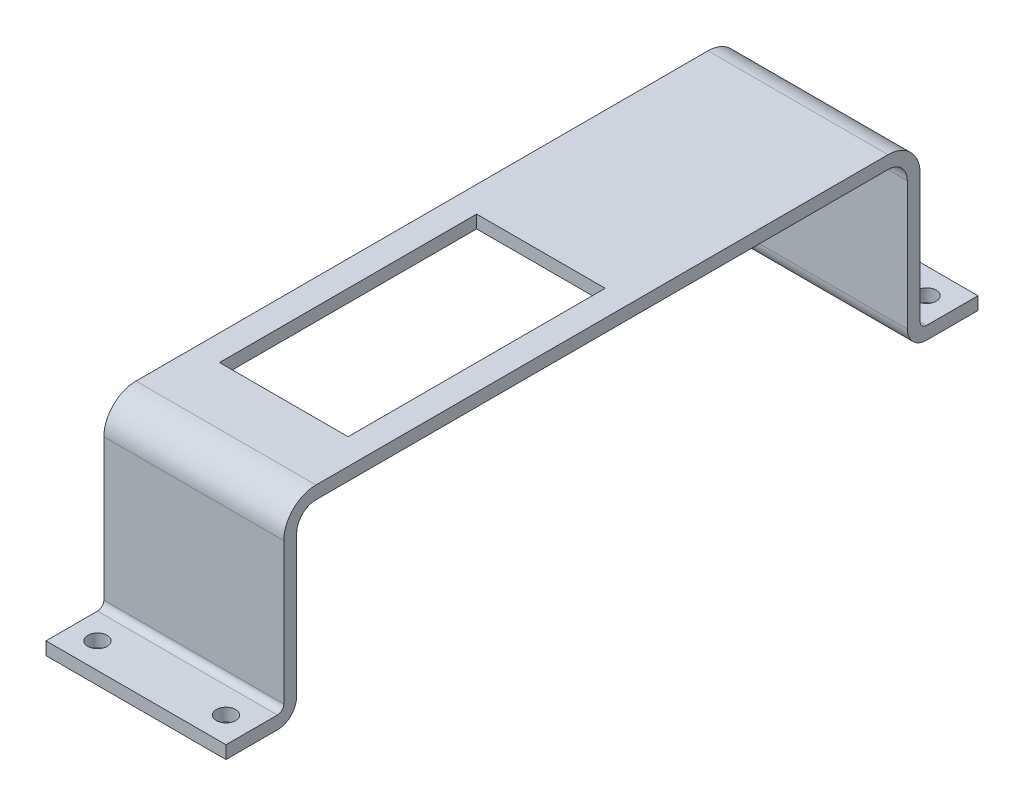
ISO-10303-21;
HEADER;
FILE_DESCRIPTION(('STEP AP214'),'2;1');
FILE_NAME('part.step','',(''),(''),'','','');
FILE_SCHEMA(('AUTOMOTIVE_DESIGN { 1 0 10303 214 1 1 1 1 }'));
ENDSEC;
DATA;
#1=APPLICATION_CONTEXT('core data for automotive mechanical design processes');
#2=APPLICATION_PROTOCOL_DEFINITION('international standard','automotive_design',2000,#1);
#3=PRODUCT_CONTEXT('',#1,'mechanical');
#4=PRODUCT('Part','Part','',(#3));
#5=PRODUCT_RELATED_PRODUCT_CATEGORY('part','',(#4));
#6=PRODUCT_DEFINITION_FORMATION('','',#4);
#7=PRODUCT_DEFINITION_CONTEXT('part definition',#1,'design');
#8=PRODUCT_DEFINITION('design','',#6,#7);
#9=PRODUCT_DEFINITION_SHAPE('','',#8);
#10=(LENGTH_UNIT() NAMED_UNIT(*) SI_UNIT(.MILLI.,.METRE.));
#11=(NAMED_UNIT(*) PLANE_ANGLE_UNIT() SI_UNIT($,.RADIAN.));
#12=(NAMED_UNIT(*) SI_UNIT($,.STERADIAN.) SOLID_ANGLE_UNIT());
#13=UNCERTAINTY_MEASURE_WITH_UNIT(LENGTH_MEASURE(1.E-05),#10,'distance_accuracy_value','');
#14=(GEOMETRIC_REPRESENTATION_CONTEXT(3) GLOBAL_UNCERTAINTY_ASSIGNED_CONTEXT((#13)) GLOBAL_UNIT_ASSIGNED_CONTEXT((#10,
#11,#12)) REPRESENTATION_CONTEXT('',''));
#15=CARTESIAN_POINT('',(0.,0.,0.));
#16=DIRECTION('',(0.,0.,1.));
#17=DIRECTION('',(1.,0.,0.));
#18=AXIS2_PLACEMENT_3D('',#15,#16,#17);
#19=CARTESIAN_POINT('',(14.,2.,-11.));
#20=DIRECTION('',(0.,0.,1.));
#21=DIRECTION('',(1.,0.,0.));
#22=AXIS2_PLACEMENT_3D('',#19,#20,#21);
#23=PLANE('',#22);
#24=DIRECTION('',(0.,1.,0.));
#25=VECTOR('',#24,1.);
#26=CARTESIAN_POINT('',(-14.,2.,-11.));
#27=LINE('',#26,#25);
#28=CARTESIAN_POINT('',(-14.,0.,-11.));
#29=VERTEX_POINT('',#28);
#30=CARTESIAN_POINT('',(-14.,2.,-11.));
#31=VERTEX_POINT('',#30);
#32=EDGE_CURVE('E221',#29,#31,#27,.T.);
#33=ORIENTED_EDGE('',*,*,#32,.T.);
#34=DIRECTION('',(-1.,0.,0.));
#35=VECTOR('',#34,1.);
#36=CARTESIAN_POINT('',(14.,2.,-11.));
#37=LINE('',#36,#35);
#38=CARTESIAN_POINT('',(14.,2.,-11.));
#39=VERTEX_POINT('',#38);
#40=EDGE_CURVE('E362',#39,#31,#37,.T.);
#41=ORIENTED_EDGE('',*,*,#40,.F.);
#42=DIRECTION('',(0.,1.,0.));
#43=VECTOR('',#42,1.);
#44=CARTESIAN_POINT('',(14.,2.,-11.));
#45=LINE('',#44,#43);
#46=CARTESIAN_POINT('',(14.,0.,-11.));
#47=VERTEX_POINT('',#46);
#48=EDGE_CURVE('E224',#47,#39,#45,.T.);
#49=ORIENTED_EDGE('',*,*,#48,.F.);
#50=DIRECTION('',(-1.,0.,0.));
#51=VECTOR('',#50,1.);
#52=CARTESIAN_POINT('',(14.,0.,-11.));
#53=LINE('',#52,#51);
#54=EDGE_CURVE('E266',#47,#29,#53,.T.);
#55=ORIENTED_EDGE('',*,*,#54,.T.);
#56=EDGE_LOOP('',(#33,#41,#49,#55));
#57=FACE_BOUND('',#56,.T.);
#58=ADVANCED_FACE('F33',(#57),#23,.F.);
#59=CARTESIAN_POINT('',(14.,2.,-3.));
#60=DIRECTION('',(0.,-1.,0.));
#61=DIRECTION('',(0.,0.,-1.));
#62=AXIS2_PLACEMENT_3D('',#59,#60,#61);
#63=PLANE('',#62);
#64=CARTESIAN_POINT('',(-10.,2.,-7.));
#65=DIRECTION('',(0.,1.,0.));
#66=DIRECTION('',(0.,0.,1.));
#67=AXIS2_PLACEMENT_3D('',#64,#65,#66);
#68=CIRCLE('',#67,1.5);
#69=CARTESIAN_POINT('',(-10.,2.,-5.5));
#70=VERTEX_POINT('',#69);
#71=EDGE_CURVE('E383',#70,#70,#68,.T.);
#72=ORIENTED_EDGE('',*,*,#71,.F.);
#73=EDGE_LOOP('',(#72));
#74=FACE_BOUND('',#73,.T.);
#75=CARTESIAN_POINT('',(10.,2.,-7.));
#76=DIRECTION('',(0.,1.,0.));
#77=DIRECTION('',(0.,0.,1.));
#78=AXIS2_PLACEMENT_3D('',#75,#76,#77);
#79=CIRCLE('',#78,1.5);
#80=CARTESIAN_POINT('',(10.,2.,-5.5));
#81=VERTEX_POINT('',#80);
#82=EDGE_CURVE('E372',#81,#81,#79,.T.);
#83=ORIENTED_EDGE('',*,*,#82,.F.);
#84=EDGE_LOOP('',(#83));
#85=FACE_BOUND('',#84,.T.);
#86=DIRECTION('',(0.,0.,1.));
#87=VECTOR('',#86,1.);
#88=CARTESIAN_POINT('',(-14.,2.,-3.));
#89=LINE('',#88,#87);
#90=CARTESIAN_POINT('',(-14.,2.,-3.));
#91=VERTEX_POINT('',#90);
#92=EDGE_CURVE('E269',#31,#91,#89,.T.);
#93=ORIENTED_EDGE('',*,*,#92,.T.);
#94=DIRECTION('',(-1.,0.,0.));
#95=VECTOR('',#94,1.);
#96=CARTESIAN_POINT('',(14.,2.,-3.));
#97=LINE('',#96,#95);
#98=CARTESIAN_POINT('',(14.,2.,-3.));
#99=VERTEX_POINT('',#98);
#100=EDGE_CURVE('E359',#99,#91,#97,.T.);
#101=ORIENTED_EDGE('',*,*,#100,.F.);
#102=DIRECTION('',(0.,0.,1.));
#103=VECTOR('',#102,1.);
#104=CARTESIAN_POINT('',(14.,2.,-3.));
#105=LINE('',#104,#103);
#106=EDGE_CURVE('E227',#39,#99,#105,.T.);
#107=ORIENTED_EDGE('',*,*,#106,.F.);
#108=ORIENTED_EDGE('',*,*,#40,.T.);
#109=EDGE_LOOP('',(#93,#101,#107,#108));
#110=FACE_BOUND('',#109,.T.);
#111=ADVANCED_FACE('F465',(#74,#85,#110),#63,.F.);
#112=CARTESIAN_POINT('',(14.,3.,-3.));
#113=DIRECTION('',(-1.,0.,0.));
#114=DIRECTION('',(0.,0.,1.));
#115=AXIS2_PLACEMENT_3D('',#112,#113,#114);
#116=CYLINDRICAL_SURFACE('',#115,1.);
#117=CARTESIAN_POINT('',(-14.,3.,-3.));
#118=DIRECTION('',(-1.,0.,0.));
#119=DIRECTION('',(0.,0.,-1.));
#120=AXIS2_PLACEMENT_3D('',#117,#118,#119);
#121=CIRCLE('',#120,1.);
#122=CARTESIAN_POINT('',(-14.,3.,-2.));
#123=VERTEX_POINT('',#122);
#124=EDGE_CURVE('E271',#91,#123,#121,.T.);
#125=ORIENTED_EDGE('',*,*,#124,.T.);
#126=DIRECTION('',(-1.,0.,0.));
#127=VECTOR('',#126,1.);
#128=CARTESIAN_POINT('',(14.,3.,-2.));
#129=LINE('',#128,#127);
#130=CARTESIAN_POINT('',(14.,3.,-2.));
#131=VERTEX_POINT('',#130);
#132=EDGE_CURVE('E356',#131,#123,#129,.T.);
#133=ORIENTED_EDGE('',*,*,#132,.F.);
#134=CARTESIAN_POINT('',(14.,3.,-3.));
#135=DIRECTION('',(-1.,0.,0.));
#136=DIRECTION('',(0.,0.,-1.));
#137=AXIS2_PLACEMENT_3D('',#134,#135,#136);
#138=CIRCLE('',#137,1.);
#139=EDGE_CURVE('E230',#99,#131,#138,.T.);
#140=ORIENTED_EDGE('',*,*,#139,.F.);
#141=ORIENTED_EDGE('',*,*,#100,.T.);
#142=EDGE_LOOP('',(#125,#133,#140,#141));
#143=FACE_BOUND('',#142,.T.);
#144=ADVANCED_FACE('F460',(#143),#116,.F.);
#145=CARTESIAN_POINT('',(14.,23.,-2.));
#146=DIRECTION('',(0.,0.,1.));
#147=DIRECTION('',(0.,-1.,0.));
#148=AXIS2_PLACEMENT_3D('',#145,#146,#147);
#149=PLANE('',#148);
#150=DIRECTION('',(0.,1.,0.));
#151=VECTOR('',#150,1.);
#152=CARTESIAN_POINT('',(-14.,23.,-2.));
#153=LINE('',#152,#151);
#154=CARTESIAN_POINT('',(-14.,23.,-2.));
#155=VERTEX_POINT('',#154);
#156=EDGE_CURVE('E273',#123,#155,#153,.T.);
#157=ORIENTED_EDGE('',*,*,#156,.T.);
#158=DIRECTION('',(-1.,0.,0.));
#159=VECTOR('',#158,1.);
#160=CARTESIAN_POINT('',(14.,23.,-2.));
#161=LINE('',#160,#159);
#162=CARTESIAN_POINT('',(14.,23.,-2.));
#163=VERTEX_POINT('',#162);
#164=EDGE_CURVE('E353',#163,#155,#161,.T.);
#165=ORIENTED_EDGE('',*,*,#164,.F.);
#166=DIRECTION('',(0.,1.,0.));
#167=VECTOR('',#166,1.);
#168=CARTESIAN_POINT('',(14.,23.,-2.));
#169=LINE('',#168,#167);
#170=EDGE_CURVE('E232',#131,#163,#169,.T.);
#171=ORIENTED_EDGE('',*,*,#170,.F.);
#172=ORIENTED_EDGE('',*,*,#132,.T.);
#173=EDGE_LOOP('',(#157,#165,#171,#172));
#174=FACE_BOUND('',#173,.T.);
#175=ADVANCED_FACE('F456',(#174),#149,.F.);
#176=CARTESIAN_POINT('',(14.,23.,3.));
#177=DIRECTION('',(-1.,0.,0.));
#178=DIRECTION('',(0.,0.,1.));
#179=AXIS2_PLACEMENT_3D('',#176,#177,#178);
#180=CYLINDRICAL_SURFACE('',#179,5.);
#181=CARTESIAN_POINT('',(-14.,23.,3.));
#182=DIRECTION('',(1.,0.,0.));
#183=DIRECTION('',(0.,0.,1.));
#184=AXIS2_PLACEMENT_3D('',#181,#182,#183);
#185=CIRCLE('',#184,5.);
#186=CARTESIAN_POINT('',(-14.,28.,3.));
#187=VERTEX_POINT('',#186);
#188=EDGE_CURVE('E275',#155,#187,#185,.T.);
#189=ORIENTED_EDGE('',*,*,#188,.T.);
#190=DIRECTION('',(-1.,0.,0.));
#191=VECTOR('',#190,1.);
#192=CARTESIAN_POINT('',(14.,28.,3.));
#193=LINE('',#192,#191);
#194=CARTESIAN_POINT('',(14.,28.,3.));
#195=VERTEX_POINT('',#194);
#196=EDGE_CURVE('E350',#195,#187,#193,.T.);
#197=ORIENTED_EDGE('',*,*,#196,.F.);
#198=CARTESIAN_POINT('',(14.,23.,3.));
#199=DIRECTION('',(1.,0.,0.));
#200=DIRECTION('',(0.,0.,1.));
#201=AXIS2_PLACEMENT_3D('',#198,#199,#200);
#202=CIRCLE('',#201,5.);
#203=EDGE_CURVE('E234',#163,#195,#202,.T.);
#204=ORIENTED_EDGE('',*,*,#203,.F.);
#205=ORIENTED_EDGE('',*,*,#164,.T.);
#206=EDGE_LOOP('',(#189,#197,#204,#205));
#207=FACE_BOUND('',#206,.T.);
#208=ADVANCED_FACE('F451',(#207),#180,.T.);
#209=CARTESIAN_POINT('',(14.,28.,3.));
#210=DIRECTION('',(0.,-1.,0.));
#211=DIRECTION('',(0.,0.,-1.));
#212=AXIS2_PLACEMENT_3D('',#209,#210,#211);
#213=PLANE('',#212);
#214=DIRECTION('',(1.,0.,0.));
#215=VECTOR('',#214,1.);
#216=CARTESIAN_POINT('',(-9.99999999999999,28.,83.));
#217=LINE('',#216,#215);
#218=CARTESIAN_POINT('',(-9.99999999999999,28.,83.));
#219=VERTEX_POINT('',#218);
#220=CARTESIAN_POINT('',(10.,28.,83.));
#221=VERTEX_POINT('',#220);
#222=EDGE_CURVE('E207',#219,#221,#217,.T.);
#223=ORIENTED_EDGE('',*,*,#222,.F.);
#224=DIRECTION('',(0.,0.,1.));
#225=VECTOR('',#224,1.);
#226=CARTESIAN_POINT('',(-9.99999999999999,28.,43.));
#227=LINE('',#226,#225);
#228=CARTESIAN_POINT('',(-9.99999999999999,28.,43.));
#229=VERTEX_POINT('',#228);
#230=EDGE_CURVE('E49',#229,#219,#227,.T.);
#231=ORIENTED_EDGE('',*,*,#230,.F.);
#232=DIRECTION('',(-1.,0.,0.));
#233=VECTOR('',#232,1.);
#234=CARTESIAN_POINT('',(-9.99999999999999,28.,43.));
#235=LINE('',#234,#233);
#236=CARTESIAN_POINT('',(10.,28.,43.));
#237=VERTEX_POINT('',#236);
#238=EDGE_CURVE('E214',#237,#229,#235,.T.);
#239=ORIENTED_EDGE('',*,*,#238,.F.);
#240=DIRECTION('',(0.,0.,-1.));
#241=VECTOR('',#240,1.);
#242=CARTESIAN_POINT('',(10.,28.,43.));
#243=LINE('',#242,#241);
#244=EDGE_CURVE('E198',#221,#237,#243,.T.);
#245=ORIENTED_EDGE('',*,*,#244,.F.);
#246=EDGE_LOOP('',(#223,#231,#239,#245));
#247=FACE_BOUND('',#246,.T.);
#248=DIRECTION('',(0.,0.,1.));
#249=VECTOR('',#248,1.);
#250=CARTESIAN_POINT('',(-14.,28.,3.));
#251=LINE('',#250,#249);
#252=CARTESIAN_POINT('',(-14.,28.,92.));
#253=VERTEX_POINT('',#252);
#254=EDGE_CURVE('E277',#187,#253,#251,.T.);
#255=ORIENTED_EDGE('',*,*,#254,.T.);
#256=DIRECTION('',(-1.,0.,0.));
#257=VECTOR('',#256,1.);
#258=CARTESIAN_POINT('',(14.,28.,92.));
#259=LINE('',#258,#257);
#260=CARTESIAN_POINT('',(14.,28.,92.));
#261=VERTEX_POINT('',#260);
#262=EDGE_CURVE('E347',#261,#253,#259,.T.);
#263=ORIENTED_EDGE('',*,*,#262,.F.);
#264=DIRECTION('',(0.,0.,1.));
#265=VECTOR('',#264,1.);
#266=CARTESIAN_POINT('',(14.,28.,3.));
#267=LINE('',#266,#265);
#268=EDGE_CURVE('E236',#195,#261,#267,.T.);
#269=ORIENTED_EDGE('',*,*,#268,.F.);
#270=ORIENTED_EDGE('',*,*,#196,.T.);
#271=EDGE_LOOP('',(#255,#263,#269,#270));
#272=FACE_BOUND('',#271,.T.);
#273=ADVANCED_FACE('F211',(#247,#272),#213,.F.);
#274=CARTESIAN_POINT('',(14.,23.,92.));
#275=DIRECTION('',(-1.,0.,0.));
#276=DIRECTION('',(0.,0.,1.));
#277=AXIS2_PLACEMENT_3D('',#274,#275,#276);
#278=CYLINDRICAL_SURFACE('',#277,5.);
#279=CARTESIAN_POINT('',(-14.,23.,92.));
#280=DIRECTION('',(1.,0.,0.));
#281=DIRECTION('',(0.,0.,-1.));
#282=AXIS2_PLACEMENT_3D('',#279,#280,#281);
#283=CIRCLE('',#282,5.);
#284=CARTESIAN_POINT('',(-14.,23.,97.));
#285=VERTEX_POINT('',#284);
#286=EDGE_CURVE('E279',#253,#285,#283,.T.);
#287=ORIENTED_EDGE('',*,*,#286,.T.);
#288=DIRECTION('',(-1.,0.,0.));
#289=VECTOR('',#288,1.);
#290=CARTESIAN_POINT('',(14.,23.,97.));
#291=LINE('',#290,#289);
#292=CARTESIAN_POINT('',(14.,23.,97.));
#293=VERTEX_POINT('',#292);
#294=EDGE_CURVE('E344',#293,#285,#291,.T.);
#295=ORIENTED_EDGE('',*,*,#294,.F.);
#296=CARTESIAN_POINT('',(14.,23.,92.));
#297=DIRECTION('',(1.,0.,0.));
#298=DIRECTION('',(0.,0.,-1.));
#299=AXIS2_PLACEMENT_3D('',#296,#297,#298);
#300=CIRCLE('',#299,5.);
#301=EDGE_CURVE('E238',#261,#293,#300,.T.);
#302=ORIENTED_EDGE('',*,*,#301,.F.);
#303=ORIENTED_EDGE('',*,*,#262,.T.);
#304=EDGE_LOOP('',(#287,#295,#302,#303));
#305=FACE_BOUND('',#304,.T.);
#306=ADVANCED_FACE('F443',(#305),#278,.T.);
#307=CARTESIAN_POINT('',(14.,23.,97.));
#308=DIRECTION('',(0.,0.,-1.));
#309=DIRECTION('',(-1.,0.,0.));
#310=AXIS2_PLACEMENT_3D('',#307,#308,#309);
#311=PLANE('',#310);
#312=DIRECTION('',(0.,-1.,0.));
#313=VECTOR('',#312,1.);
#314=CARTESIAN_POINT('',(-14.,23.,97.));
#315=LINE('',#314,#313);
#316=CARTESIAN_POINT('',(-14.,0.999999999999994,97.));
#317=VERTEX_POINT('',#316);
#318=EDGE_CURVE('E281',#285,#317,#315,.T.);
#319=ORIENTED_EDGE('',*,*,#318,.T.);
#320=DIRECTION('',(-1.,0.,0.));
#321=VECTOR('',#320,1.);
#322=CARTESIAN_POINT('',(14.,0.999999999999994,97.));
#323=LINE('',#322,#321);
#324=CARTESIAN_POINT('',(14.,0.999999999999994,97.));
#325=VERTEX_POINT('',#324);
#326=EDGE_CURVE('E341',#325,#317,#323,.T.);
#327=ORIENTED_EDGE('',*,*,#326,.F.);
#328=DIRECTION('',(0.,-1.,0.));
#329=VECTOR('',#328,1.);
#330=CARTESIAN_POINT('',(14.,23.,97.));
#331=LINE('',#330,#329);
#332=EDGE_CURVE('E240',#293,#325,#331,.T.);
#333=ORIENTED_EDGE('',*,*,#332,.F.);
#334=ORIENTED_EDGE('',*,*,#294,.T.);
#335=EDGE_LOOP('',(#319,#327,#333,#334));
#336=FACE_BOUND('',#335,.T.);
#337=ADVANCED_FACE('F439',(#336),#311,.F.);
#338=CARTESIAN_POINT('',(14.,0.999999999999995,98.));
#339=DIRECTION('',(-1.,0.,0.));
#340=DIRECTION('',(0.,0.,1.));
#341=AXIS2_PLACEMENT_3D('',#338,#339,#340);
#342=CYLINDRICAL_SURFACE('',#341,1.);
#343=CARTESIAN_POINT('',(-14.,0.999999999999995,98.));
#344=DIRECTION('',(-1.,0.,0.));
#345=DIRECTION('',(0.,0.,1.));
#346=AXIS2_PLACEMENT_3D('',#343,#344,#345);
#347=CIRCLE('',#346,1.);
#348=CARTESIAN_POINT('',(-14.,0.,98.));
#349=VERTEX_POINT('',#348);
#350=EDGE_CURVE('E283',#317,#349,#347,.T.);
#351=ORIENTED_EDGE('',*,*,#350,.T.);
#352=DIRECTION('',(-1.,0.,0.));
#353=VECTOR('',#352,1.);
#354=CARTESIAN_POINT('',(14.,0.,98.));
#355=LINE('',#354,#353);
#356=CARTESIAN_POINT('',(14.,0.,98.));
#357=VERTEX_POINT('',#356);
#358=EDGE_CURVE('E338',#357,#349,#355,.T.);
#359=ORIENTED_EDGE('',*,*,#358,.F.);
#360=CARTESIAN_POINT('',(14.,0.999999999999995,98.));
#361=DIRECTION('',(-1.,0.,0.));
#362=DIRECTION('',(0.,0.,1.));
#363=AXIS2_PLACEMENT_3D('',#360,#361,#362);
#364=CIRCLE('',#363,1.);
#365=EDGE_CURVE('E242',#325,#357,#364,.T.);
#366=ORIENTED_EDGE('',*,*,#365,.F.);
#367=ORIENTED_EDGE('',*,*,#326,.T.);
#368=EDGE_LOOP('',(#351,#359,#366,#367));
#369=FACE_BOUND('',#368,.T.);
#370=ADVANCED_FACE('F401',(#369),#342,.F.);
#371=CARTESIAN_POINT('',(14.,0.,98.));
#372=DIRECTION('',(0.,-1.,0.));
#373=DIRECTION('',(0.,0.,-1.));
#374=AXIS2_PLACEMENT_3D('',#371,#372,#373);
#375=PLANE('',#374);
#376=CARTESIAN_POINT('',(-10.,0.,102.));
#377=DIRECTION('',(0.,1.,0.));
#378=DIRECTION('',(0.,0.,1.));
#379=AXIS2_PLACEMENT_3D('',#376,#377,#378);
#380=CIRCLE('',#379,1.5);
#381=CARTESIAN_POINT('',(-10.,0.,103.5));
#382=VERTEX_POINT('',#381);
#383=EDGE_CURVE('E371',#382,#382,#380,.T.);
#384=ORIENTED_EDGE('',*,*,#383,.F.);
#385=EDGE_LOOP('',(#384));
#386=FACE_BOUND('',#385,.T.);
#387=CARTESIAN_POINT('',(10.,0.,102.));
#388=DIRECTION('',(0.,1.,0.));
#389=DIRECTION('',(0.,0.,1.));
#390=AXIS2_PLACEMENT_3D('',#387,#388,#389);
#391=CIRCLE('',#390,1.5);
#392=CARTESIAN_POINT('',(10.,0.,103.5));
#393=VERTEX_POINT('',#392);
#394=EDGE_CURVE('E387',#393,#393,#391,.T.);
#395=ORIENTED_EDGE('',*,*,#394,.F.);
#396=EDGE_LOOP('',(#395));
#397=FACE_BOUND('',#396,.T.);
#398=DIRECTION('',(0.,0.,1.));
#399=VECTOR('',#398,1.);
#400=CARTESIAN_POINT('',(-14.,0.,98.));
#401=LINE('',#400,#399);
#402=CARTESIAN_POINT('',(-14.,0.,106.));
#403=VERTEX_POINT('',#402);
#404=EDGE_CURVE('E285',#349,#403,#401,.T.);
#405=ORIENTED_EDGE('',*,*,#404,.T.);
#406=DIRECTION('',(-1.,0.,0.));
#407=VECTOR('',#406,1.);
#408=CARTESIAN_POINT('',(14.,0.,106.));
#409=LINE('',#408,#407);
#410=CARTESIAN_POINT('',(14.,0.,106.));
#411=VERTEX_POINT('',#410);
#412=EDGE_CURVE('E335',#411,#403,#409,.T.);
#413=ORIENTED_EDGE('',*,*,#412,.F.);
#414=DIRECTION('',(0.,0.,1.));
#415=VECTOR('',#414,1.);
#416=CARTESIAN_POINT('',(14.,0.,98.));
#417=LINE('',#416,#415);
#418=EDGE_CURVE('E244',#357,#411,#417,.T.);
#419=ORIENTED_EDGE('',*,*,#418,.F.);
#420=ORIENTED_EDGE('',*,*,#358,.T.);
#421=EDGE_LOOP('',(#405,#413,#419,#420));
#422=FACE_BOUND('',#421,.T.);
#423=ADVANCED_FACE('F397',(#386,#397,#422),#375,.F.);
#424=CARTESIAN_POINT('',(14.,0.,106.));
#425=DIRECTION('',(0.,0.,-1.));
#426=DIRECTION('',(-1.,0.,0.));
#427=AXIS2_PLACEMENT_3D('',#424,#425,#426);
#428=PLANE('',#427);
#429=DIRECTION('',(0.,-1.,0.));
#430=VECTOR('',#429,1.);
#431=CARTESIAN_POINT('',(-14.,0.,106.));
#432=LINE('',#431,#430);
#433=CARTESIAN_POINT('',(-14.,-2.00000000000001,106.));
#434=VERTEX_POINT('',#433);
#435=EDGE_CURVE('E287',#403,#434,#432,.T.);
#436=ORIENTED_EDGE('',*,*,#435,.T.);
#437=DIRECTION('',(-1.,0.,0.));
#438=VECTOR('',#437,1.);
#439=CARTESIAN_POINT('',(14.,-2.00000000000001,106.));
#440=LINE('',#439,#438);
#441=CARTESIAN_POINT('',(14.,-2.00000000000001,106.));
#442=VERTEX_POINT('',#441);
#443=EDGE_CURVE('E332',#442,#434,#440,.T.);
#444=ORIENTED_EDGE('',*,*,#443,.F.);
#445=DIRECTION('',(0.,-1.,0.));
#446=VECTOR('',#445,1.);
#447=CARTESIAN_POINT('',(14.,0.,106.));
#448=LINE('',#447,#446);
#449=EDGE_CURVE('E246',#411,#442,#448,.T.);
#450=ORIENTED_EDGE('',*,*,#449,.F.);
#451=ORIENTED_EDGE('',*,*,#412,.T.);
#452=EDGE_LOOP('',(#436,#444,#450,#451));
#453=FACE_BOUND('',#452,.T.);
#454=ADVANCED_FACE('F400',(#453),#428,.F.);
#455=CARTESIAN_POINT('',(14.,-2.00000000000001,98.));
#456=DIRECTION('',(0.,1.,0.));
#457=DIRECTION('',(0.,0.,1.));
#458=AXIS2_PLACEMENT_3D('',#455,#456,#457);
#459=PLANE('',#458);
#460=CARTESIAN_POINT('',(-10.,-2.00000000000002,102.));
#461=DIRECTION('',(0.,1.,0.));
#462=DIRECTION('',(0.,0.,1.));
#463=AXIS2_PLACEMENT_3D('',#460,#461,#462);
#464=CIRCLE('',#463,1.5);
#465=CARTESIAN_POINT('',(-10.,-2.00000000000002,103.5));
#466=VERTEX_POINT('',#465);
#467=EDGE_CURVE('E376',#466,#466,#464,.T.);
#468=ORIENTED_EDGE('',*,*,#467,.T.);
#469=EDGE_LOOP('',(#468));
#470=FACE_BOUND('',#469,.T.);
#471=CARTESIAN_POINT('',(10.,-2.00000000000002,102.));
#472=DIRECTION('',(0.,1.,0.));
#473=DIRECTION('',(0.,0.,1.));
#474=AXIS2_PLACEMENT_3D('',#471,#472,#473);
#475=CIRCLE('',#474,1.5);
#476=CARTESIAN_POINT('',(10.,-2.00000000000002,103.5));
#477=VERTEX_POINT('',#476);
#478=EDGE_CURVE('E389',#477,#477,#475,.T.);
#479=ORIENTED_EDGE('',*,*,#478,.T.);
#480=EDGE_LOOP('',(#479));
#481=FACE_BOUND('',#480,.T.);
#482=DIRECTION('',(0.,0.,-1.));
#483=VECTOR('',#482,1.);
#484=CARTESIAN_POINT('',(-14.,-2.00000000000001,98.));
#485=LINE('',#484,#483);
#486=CARTESIAN_POINT('',(-14.,-2.00000000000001,98.));
#487=VERTEX_POINT('',#486);
#488=EDGE_CURVE('E289',#434,#487,#485,.T.);
#489=ORIENTED_EDGE('',*,*,#488,.T.);
#490=DIRECTION('',(-1.,0.,0.));
#491=VECTOR('',#490,1.);
#492=CARTESIAN_POINT('',(14.,-2.00000000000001,98.));
#493=LINE('',#492,#491);
#494=CARTESIAN_POINT('',(14.,-2.00000000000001,98.));
#495=VERTEX_POINT('',#494);
#496=EDGE_CURVE('E329',#495,#487,#493,.T.);
#497=ORIENTED_EDGE('',*,*,#496,.F.);
#498=DIRECTION('',(0.,0.,-1.));
#499=VECTOR('',#498,1.);
#500=CARTESIAN_POINT('',(14.,-2.00000000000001,98.));
#501=LINE('',#500,#499);
#502=EDGE_CURVE('E248',#442,#495,#501,.T.);
#503=ORIENTED_EDGE('',*,*,#502,.F.);
#504=ORIENTED_EDGE('',*,*,#443,.T.);
#505=EDGE_LOOP('',(#489,#497,#503,#504));
#506=FACE_BOUND('',#505,.T.);
#507=ADVANCED_FACE('F421',(#470,#481,#506),#459,.F.);
#508=CARTESIAN_POINT('',(14.,0.999999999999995,98.));
#509=DIRECTION('',(-1.,0.,0.));
#510=DIRECTION('',(0.,0.,1.));
#511=AXIS2_PLACEMENT_3D('',#508,#509,#510);
#512=CYLINDRICAL_SURFACE('',#511,3.);
#513=CARTESIAN_POINT('',(-14.,0.999999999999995,98.));
#514=DIRECTION('',(1.,0.,0.));
#515=DIRECTION('',(0.,0.,1.));
#516=AXIS2_PLACEMENT_3D('',#513,#514,#515);
#517=CIRCLE('',#516,3.);
#518=CARTESIAN_POINT('',(-14.,0.999999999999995,95.));
#519=VERTEX_POINT('',#518);
#520=EDGE_CURVE('E291',#487,#519,#517,.T.);
#521=ORIENTED_EDGE('',*,*,#520,.T.);
#522=DIRECTION('',(-1.,0.,0.));
#523=VECTOR('',#522,1.);
#524=CARTESIAN_POINT('',(14.,0.999999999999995,95.));
#525=LINE('',#524,#523);
#526=CARTESIAN_POINT('',(14.,0.999999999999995,95.));
#527=VERTEX_POINT('',#526);
#528=EDGE_CURVE('E326',#527,#519,#525,.T.);
#529=ORIENTED_EDGE('',*,*,#528,.F.);
#530=CARTESIAN_POINT('',(14.,0.999999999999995,98.));
#531=DIRECTION('',(1.,0.,0.));
#532=DIRECTION('',(0.,0.,1.));
#533=AXIS2_PLACEMENT_3D('',#530,#531,#532);
#534=CIRCLE('',#533,3.);
#535=EDGE_CURVE('E250',#495,#527,#534,.T.);
#536=ORIENTED_EDGE('',*,*,#535,.F.);
#537=ORIENTED_EDGE('',*,*,#496,.T.);
#538=EDGE_LOOP('',(#521,#529,#536,#537));
#539=FACE_BOUND('',#538,.T.);
#540=ADVANCED_FACE('F425',(#539),#512,.T.);
#541=CARTESIAN_POINT('',(14.,23.,95.));
#542=DIRECTION('',(0.,0.,1.));
#543=DIRECTION('',(1.,0.,0.));
#544=AXIS2_PLACEMENT_3D('',#541,#542,#543);
#545=PLANE('',#544);
#546=DIRECTION('',(0.,1.,0.));
#547=VECTOR('',#546,1.);
#548=CARTESIAN_POINT('',(-14.,23.,95.));
#549=LINE('',#548,#547);
#550=CARTESIAN_POINT('',(-14.,23.,95.));
#551=VERTEX_POINT('',#550);
#552=EDGE_CURVE('E293',#519,#551,#549,.T.);
#553=ORIENTED_EDGE('',*,*,#552,.T.);
#554=DIRECTION('',(-1.,0.,0.));
#555=VECTOR('',#554,1.);
#556=CARTESIAN_POINT('',(14.,23.,95.));
#557=LINE('',#556,#555);
#558=CARTESIAN_POINT('',(14.,23.,95.));
#559=VERTEX_POINT('',#558);
#560=EDGE_CURVE('E323',#559,#551,#557,.T.);
#561=ORIENTED_EDGE('',*,*,#560,.F.);
#562=DIRECTION('',(0.,1.,0.));
#563=VECTOR('',#562,1.);
#564=CARTESIAN_POINT('',(14.,23.,95.));
#565=LINE('',#564,#563);
#566=EDGE_CURVE('E252',#527,#559,#565,.T.);
#567=ORIENTED_EDGE('',*,*,#566,.F.);
#568=ORIENTED_EDGE('',*,*,#528,.T.);
#569=EDGE_LOOP('',(#553,#561,#567,#568));
#570=FACE_BOUND('',#569,.T.);
#571=ADVANCED_FACE('F498',(#570),#545,.F.);
#572=CARTESIAN_POINT('',(14.,23.,92.));
#573=DIRECTION('',(-1.,0.,0.));
#574=DIRECTION('',(0.,0.,1.));
#575=AXIS2_PLACEMENT_3D('',#572,#573,#574);
#576=CYLINDRICAL_SURFACE('',#575,3.);
#577=CARTESIAN_POINT('',(-14.,23.,92.));
#578=DIRECTION('',(-1.,0.,0.));
#579=DIRECTION('',(0.,0.,-1.));
#580=AXIS2_PLACEMENT_3D('',#577,#578,#579);
#581=CIRCLE('',#580,3.);
#582=CARTESIAN_POINT('',(-14.,26.,92.));
#583=VERTEX_POINT('',#582);
#584=EDGE_CURVE('E295',#551,#583,#581,.T.);
#585=ORIENTED_EDGE('',*,*,#584,.T.);
#586=DIRECTION('',(-1.,0.,0.));
#587=VECTOR('',#586,1.);
#588=CARTESIAN_POINT('',(14.,26.,92.));
#589=LINE('',#588,#587);
#590=CARTESIAN_POINT('',(14.,26.,92.));
#591=VERTEX_POINT('',#590);
#592=EDGE_CURVE('E320',#591,#583,#589,.T.);
#593=ORIENTED_EDGE('',*,*,#592,.F.);
#594=CARTESIAN_POINT('',(14.,23.,92.));
#595=DIRECTION('',(-1.,0.,0.));
#596=DIRECTION('',(0.,0.,-1.));
#597=AXIS2_PLACEMENT_3D('',#594,#595,#596);
#598=CIRCLE('',#597,3.);
#599=EDGE_CURVE('E254',#559,#591,#598,.T.);
#600=ORIENTED_EDGE('',*,*,#599,.F.);
#601=ORIENTED_EDGE('',*,*,#560,.T.);
#602=EDGE_LOOP('',(#585,#593,#600,#601));
#603=FACE_BOUND('',#602,.T.);
#604=ADVANCED_FACE('F496',(#603),#576,.F.);
#605=CARTESIAN_POINT('',(14.,26.,3.));
#606=DIRECTION('',(0.,1.,0.));
#607=DIRECTION('',(0.,0.,1.));
#608=AXIS2_PLACEMENT_3D('',#605,#606,#607);
#609=PLANE('',#608);
#610=DIRECTION('',(-1.,0.,0.));
#611=VECTOR('',#610,1.);
#612=CARTESIAN_POINT('',(14.,26.,43.));
#613=LINE('',#612,#611);
#614=CARTESIAN_POINT('',(10.,26.,43.));
#615=VERTEX_POINT('',#614);
#616=CARTESIAN_POINT('',(-9.99999999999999,26.,43.));
#617=VERTEX_POINT('',#616);
#618=EDGE_CURVE('E41',#615,#617,#613,.T.);
#619=ORIENTED_EDGE('',*,*,#618,.T.);
#620=DIRECTION('',(0.,0.,1.));
#621=VECTOR('',#620,1.);
#622=CARTESIAN_POINT('',(-10.,26.,3.));
#623=LINE('',#622,#621);
#624=CARTESIAN_POINT('',(-9.99999999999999,26.,83.));
#625=VERTEX_POINT('',#624);
#626=EDGE_CURVE('E11',#617,#625,#623,.T.);
#627=ORIENTED_EDGE('',*,*,#626,.T.);
#628=DIRECTION('',(1.,0.,0.));
#629=VECTOR('',#628,1.);
#630=CARTESIAN_POINT('',(14.,26.,83.));
#631=LINE('',#630,#629);
#632=CARTESIAN_POINT('',(10.,26.,83.));
#633=VERTEX_POINT('',#632);
#634=EDGE_CURVE('E365',#625,#633,#631,.T.);
#635=ORIENTED_EDGE('',*,*,#634,.T.);
#636=DIRECTION('',(0.,0.,-1.));
#637=VECTOR('',#636,1.);
#638=CARTESIAN_POINT('',(10.,26.,3.));
#639=LINE('',#638,#637);
#640=EDGE_CURVE('E201',#633,#615,#639,.T.);
#641=ORIENTED_EDGE('',*,*,#640,.T.);
#642=EDGE_LOOP('',(#619,#627,#635,#641));
#643=FACE_BOUND('',#642,.T.);
#644=DIRECTION('',(0.,0.,-1.));
#645=VECTOR('',#644,1.);
#646=CARTESIAN_POINT('',(-14.,26.,3.));
#647=LINE('',#646,#645);
#648=CARTESIAN_POINT('',(-14.,26.,3.));
#649=VERTEX_POINT('',#648);
#650=EDGE_CURVE('E297',#583,#649,#647,.T.);
#651=ORIENTED_EDGE('',*,*,#650,.T.);
#652=DIRECTION('',(-1.,0.,0.));
#653=VECTOR('',#652,1.);
#654=CARTESIAN_POINT('',(14.,26.,3.));
#655=LINE('',#654,#653);
#656=CARTESIAN_POINT('',(14.,26.,3.));
#657=VERTEX_POINT('',#656);
#658=EDGE_CURVE('E317',#657,#649,#655,.T.);
#659=ORIENTED_EDGE('',*,*,#658,.F.);
#660=DIRECTION('',(0.,0.,-1.));
#661=VECTOR('',#660,1.);
#662=CARTESIAN_POINT('',(14.,26.,3.));
#663=LINE('',#662,#661);
#664=EDGE_CURVE('E256',#591,#657,#663,.T.);
#665=ORIENTED_EDGE('',*,*,#664,.F.);
#666=ORIENTED_EDGE('',*,*,#592,.T.);
#667=EDGE_LOOP('',(#651,#659,#665,#666));
#668=FACE_BOUND('',#667,.T.);
#669=ADVANCED_FACE('F491',(#643,#668),#609,.F.);
#670=CARTESIAN_POINT('',(14.,23.,3.));
#671=DIRECTION('',(-1.,0.,0.));
#672=DIRECTION('',(0.,0.,1.));
#673=AXIS2_PLACEMENT_3D('',#670,#671,#672);
#674=CYLINDRICAL_SURFACE('',#673,3.);
#675=CARTESIAN_POINT('',(-14.,23.,3.));
#676=DIRECTION('',(-1.,0.,0.));
#677=DIRECTION('',(0.,0.,1.));
#678=AXIS2_PLACEMENT_3D('',#675,#676,#677);
#679=CIRCLE('',#678,3.);
#680=CARTESIAN_POINT('',(-14.,23.,0.));
#681=VERTEX_POINT('',#680);
#682=EDGE_CURVE('E299',#649,#681,#679,.T.);
#683=ORIENTED_EDGE('',*,*,#682,.T.);
#684=DIRECTION('',(-1.,0.,0.));
#685=VECTOR('',#684,1.);
#686=CARTESIAN_POINT('',(14.,23.,0.));
#687=LINE('',#686,#685);
#688=CARTESIAN_POINT('',(14.,23.,0.));
#689=VERTEX_POINT('',#688);
#690=EDGE_CURVE('E314',#689,#681,#687,.T.);
#691=ORIENTED_EDGE('',*,*,#690,.F.);
#692=CARTESIAN_POINT('',(14.,23.,3.));
#693=DIRECTION('',(-1.,0.,0.));
#694=DIRECTION('',(0.,0.,1.));
#695=AXIS2_PLACEMENT_3D('',#692,#693,#694);
#696=CIRCLE('',#695,3.);
#697=EDGE_CURVE('E258',#657,#689,#696,.T.);
#698=ORIENTED_EDGE('',*,*,#697,.F.);
#699=ORIENTED_EDGE('',*,*,#658,.T.);
#700=EDGE_LOOP('',(#683,#691,#698,#699));
#701=FACE_BOUND('',#700,.T.);
#702=ADVANCED_FACE('F486',(#701),#674,.F.);
#703=CARTESIAN_POINT('',(14.,23.,0.));
#704=DIRECTION('',(0.,0.,-1.));
#705=DIRECTION('',(0.,1.,0.));
#706=AXIS2_PLACEMENT_3D('',#703,#704,#705);
#707=PLANE('',#706);
#708=DIRECTION('',(0.,-1.,0.));
#709=VECTOR('',#708,1.);
#710=CARTESIAN_POINT('',(-14.,23.,0.));
#711=LINE('',#710,#709);
#712=CARTESIAN_POINT('',(-14.,3.,0.));
#713=VERTEX_POINT('',#712);
#714=EDGE_CURVE('E301',#681,#713,#711,.T.);
#715=ORIENTED_EDGE('',*,*,#714,.T.);
#716=DIRECTION('',(-1.,0.,0.));
#717=VECTOR('',#716,1.);
#718=CARTESIAN_POINT('',(14.,3.,0.));
#719=LINE('',#718,#717);
#720=CARTESIAN_POINT('',(14.,3.,0.));
#721=VERTEX_POINT('',#720);
#722=EDGE_CURVE('E311',#721,#713,#719,.T.);
#723=ORIENTED_EDGE('',*,*,#722,.F.);
#724=DIRECTION('',(0.,-1.,0.));
#725=VECTOR('',#724,1.);
#726=CARTESIAN_POINT('',(14.,23.,0.));
#727=LINE('',#726,#725);
#728=EDGE_CURVE('E260',#689,#721,#727,.T.);
#729=ORIENTED_EDGE('',*,*,#728,.F.);
#730=ORIENTED_EDGE('',*,*,#690,.T.);
#731=EDGE_LOOP('',(#715,#723,#729,#730));
#732=FACE_BOUND('',#731,.T.);
#733=ADVANCED_FACE('F482',(#732),#707,.F.);
#734=CARTESIAN_POINT('',(14.,3.,-3.));
#735=DIRECTION('',(-1.,0.,0.));
#736=DIRECTION('',(0.,0.,1.));
#737=AXIS2_PLACEMENT_3D('',#734,#735,#736);
#738=CYLINDRICAL_SURFACE('',#737,3.);
#739=CARTESIAN_POINT('',(-14.,3.,-3.));
#740=DIRECTION('',(1.,0.,0.));
#741=DIRECTION('',(0.,0.,-1.));
#742=AXIS2_PLACEMENT_3D('',#739,#740,#741);
#743=CIRCLE('',#742,3.);
#744=CARTESIAN_POINT('',(-14.,0.,-3.));
#745=VERTEX_POINT('',#744);
#746=EDGE_CURVE('E303',#713,#745,#743,.T.);
#747=ORIENTED_EDGE('',*,*,#746,.T.);
#748=DIRECTION('',(-1.,0.,0.));
#749=VECTOR('',#748,1.);
#750=CARTESIAN_POINT('',(14.,0.,-3.));
#751=LINE('',#750,#749);
#752=CARTESIAN_POINT('',(14.,0.,-3.));
#753=VERTEX_POINT('',#752);
#754=EDGE_CURVE('E308',#753,#745,#751,.T.);
#755=ORIENTED_EDGE('',*,*,#754,.F.);
#756=CARTESIAN_POINT('',(14.,3.,-3.));
#757=DIRECTION('',(1.,0.,0.));
#758=DIRECTION('',(0.,0.,-1.));
#759=AXIS2_PLACEMENT_3D('',#756,#757,#758);
#760=CIRCLE('',#759,3.);
#761=EDGE_CURVE('E262',#721,#753,#760,.T.);
#762=ORIENTED_EDGE('',*,*,#761,.F.);
#763=ORIENTED_EDGE('',*,*,#722,.T.);
#764=EDGE_LOOP('',(#747,#755,#762,#763));
#765=FACE_BOUND('',#764,.T.);
#766=ADVANCED_FACE('F477',(#765),#738,.T.);
#767=CARTESIAN_POINT('',(14.,0.,-3.));
#768=DIRECTION('',(0.,1.,0.));
#769=DIRECTION('',(0.,0.,1.));
#770=AXIS2_PLACEMENT_3D('',#767,#768,#769);
#771=PLANE('',#770);
#772=CARTESIAN_POINT('',(-10.,0.,-7.));
#773=DIRECTION('',(0.,1.,0.));
#774=DIRECTION('',(0.,0.,1.));
#775=AXIS2_PLACEMENT_3D('',#772,#773,#774);
#776=CIRCLE('',#775,1.5);
#777=CARTESIAN_POINT('',(-10.,0.,-5.5));
#778=VERTEX_POINT('',#777);
#779=EDGE_CURVE('E36',#778,#778,#776,.T.);
#780=ORIENTED_EDGE('',*,*,#779,.T.);
#781=EDGE_LOOP('',(#780));
#782=FACE_BOUND('',#781,.T.);
#783=CARTESIAN_POINT('',(10.,0.,-7.));
#784=DIRECTION('',(0.,1.,0.));
#785=DIRECTION('',(0.,0.,1.));
#786=AXIS2_PLACEMENT_3D('',#783,#784,#785);
#787=CIRCLE('',#786,1.5);
#788=CARTESIAN_POINT('',(10.,0.,-5.5));
#789=VERTEX_POINT('',#788);
#790=EDGE_CURVE('E369',#789,#789,#787,.T.);
#791=ORIENTED_EDGE('',*,*,#790,.T.);
#792=EDGE_LOOP('',(#791));
#793=FACE_BOUND('',#792,.T.);
#794=DIRECTION('',(0.,0.,-1.));
#795=VECTOR('',#794,1.);
#796=CARTESIAN_POINT('',(-14.,0.,-3.));
#797=LINE('',#796,#795);
#798=EDGE_CURVE('E228',#745,#29,#797,.T.);
#799=ORIENTED_EDGE('',*,*,#798,.T.);
#800=ORIENTED_EDGE('',*,*,#54,.F.);
#801=DIRECTION('',(0.,0.,-1.));
#802=VECTOR('',#801,1.);
#803=CARTESIAN_POINT('',(14.,0.,-3.));
#804=LINE('',#803,#802);
#805=EDGE_CURVE('E264',#753,#47,#804,.T.);
#806=ORIENTED_EDGE('',*,*,#805,.F.);
#807=ORIENTED_EDGE('',*,*,#754,.T.);
#808=EDGE_LOOP('',(#799,#800,#806,#807));
#809=FACE_BOUND('',#808,.T.);
#810=ADVANCED_FACE('F471',(#782,#793,#809),#771,.F.);
#811=CARTESIAN_POINT('',(14.,3.,-3.));
#812=DIRECTION('',(1.,0.,0.));
#813=DIRECTION('',(0.,0.,-1.));
#814=AXIS2_PLACEMENT_3D('',#811,#812,#813);
#815=PLANE('',#814);
#816=ORIENTED_EDGE('',*,*,#48,.T.);
#817=ORIENTED_EDGE('',*,*,#106,.T.);
#818=ORIENTED_EDGE('',*,*,#139,.T.);
#819=ORIENTED_EDGE('',*,*,#170,.T.);
#820=ORIENTED_EDGE('',*,*,#203,.T.);
#821=ORIENTED_EDGE('',*,*,#268,.T.);
#822=ORIENTED_EDGE('',*,*,#301,.T.);
#823=ORIENTED_EDGE('',*,*,#332,.T.);
#824=ORIENTED_EDGE('',*,*,#365,.T.);
#825=ORIENTED_EDGE('',*,*,#418,.T.);
#826=ORIENTED_EDGE('',*,*,#449,.T.);
#827=ORIENTED_EDGE('',*,*,#502,.T.);
#828=ORIENTED_EDGE('',*,*,#535,.T.);
#829=ORIENTED_EDGE('',*,*,#566,.T.);
#830=ORIENTED_EDGE('',*,*,#599,.T.);
#831=ORIENTED_EDGE('',*,*,#664,.T.);
#832=ORIENTED_EDGE('',*,*,#697,.T.);
#833=ORIENTED_EDGE('',*,*,#728,.T.);
#834=ORIENTED_EDGE('',*,*,#761,.T.);
#835=ORIENTED_EDGE('',*,*,#805,.T.);
#836=EDGE_LOOP('',(#816,#817,#818,#819,#820,#821,#822,#823,#824,#825,#826,#827,#828,#829,#830,
#831,#832,#833,#834,#835));
#837=FACE_BOUND('',#836,.T.);
#838=ADVANCED_FACE('F429',(#837),#815,.T.);
#839=CARTESIAN_POINT('',(-14.,3.,-3.));
#840=DIRECTION('',(1.,0.,0.));
#841=DIRECTION('',(0.,0.,-1.));
#842=AXIS2_PLACEMENT_3D('',#839,#840,#841);
#843=PLANE('',#842);
#844=ORIENTED_EDGE('',*,*,#32,.F.);
#845=ORIENTED_EDGE('',*,*,#798,.F.);
#846=ORIENTED_EDGE('',*,*,#746,.F.);
#847=ORIENTED_EDGE('',*,*,#714,.F.);
#848=ORIENTED_EDGE('',*,*,#682,.F.);
#849=ORIENTED_EDGE('',*,*,#650,.F.);
#850=ORIENTED_EDGE('',*,*,#584,.F.);
#851=ORIENTED_EDGE('',*,*,#552,.F.);
#852=ORIENTED_EDGE('',*,*,#520,.F.);
#853=ORIENTED_EDGE('',*,*,#488,.F.);
#854=ORIENTED_EDGE('',*,*,#435,.F.);
#855=ORIENTED_EDGE('',*,*,#404,.F.);
#856=ORIENTED_EDGE('',*,*,#350,.F.);
#857=ORIENTED_EDGE('',*,*,#318,.F.);
#858=ORIENTED_EDGE('',*,*,#286,.F.);
#859=ORIENTED_EDGE('',*,*,#254,.F.);
#860=ORIENTED_EDGE('',*,*,#188,.F.);
#861=ORIENTED_EDGE('',*,*,#156,.F.);
#862=ORIENTED_EDGE('',*,*,#124,.F.);
#863=ORIENTED_EDGE('',*,*,#92,.F.);
#864=EDGE_LOOP('',(#844,#845,#846,#847,#848,#849,#850,#851,#852,#853,#854,#855,#856,#857,#858,
#859,#860,#861,#862,#863));
#865=FACE_BOUND('',#864,.T.);
#866=ADVANCED_FACE('F416',(#865),#843,.F.);
#867=CARTESIAN_POINT('',(-9.99999999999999,-2.00000000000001,43.));
#868=DIRECTION('',(-1.,0.,0.));
#869=DIRECTION('',(0.,0.,1.));
#870=AXIS2_PLACEMENT_3D('',#867,#868,#869);
#871=PLANE('',#870);
#872=DIRECTION('',(0.,1.,0.));
#873=VECTOR('',#872,1.);
#874=CARTESIAN_POINT('',(-9.99999999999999,-2.00000000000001,43.));
#875=LINE('',#874,#873);
#876=EDGE_CURVE('E219',#617,#229,#875,.T.);
#877=ORIENTED_EDGE('',*,*,#876,.T.);
#878=ORIENTED_EDGE('',*,*,#230,.T.);
#879=DIRECTION('',(0.,1.,0.));
#880=VECTOR('',#879,1.);
#881=CARTESIAN_POINT('',(-9.99999999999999,-2.00000000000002,83.));
#882=LINE('',#881,#880);
#883=EDGE_CURVE('E204',#625,#219,#882,.T.);
#884=ORIENTED_EDGE('',*,*,#883,.F.);
#885=ORIENTED_EDGE('',*,*,#626,.F.);
#886=EDGE_LOOP('',(#877,#878,#884,#885));
#887=FACE_BOUND('',#886,.T.);
#888=ADVANCED_FACE('F557',(#887),#871,.F.);
#889=CARTESIAN_POINT('',(-9.99999999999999,-2.00000000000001,43.));
#890=DIRECTION('',(0.,0.,-1.));
#891=DIRECTION('',(-1.,0.,0.));
#892=AXIS2_PLACEMENT_3D('',#889,#890,#891);
#893=PLANE('',#892);
#894=DIRECTION('',(0.,1.,0.));
#895=VECTOR('',#894,1.);
#896=CARTESIAN_POINT('',(10.,-2.00000000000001,43.));
#897=LINE('',#896,#895);
#898=EDGE_CURVE('E203',#615,#237,#897,.T.);
#899=ORIENTED_EDGE('',*,*,#898,.T.);
#900=ORIENTED_EDGE('',*,*,#238,.T.);
#901=ORIENTED_EDGE('',*,*,#876,.F.);
#902=ORIENTED_EDGE('',*,*,#618,.F.);
#903=EDGE_LOOP('',(#899,#900,#901,#902));
#904=FACE_BOUND('',#903,.T.);
#905=ADVANCED_FACE('F554',(#904),#893,.F.);
#906=CARTESIAN_POINT('',(10.,-2.00000000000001,43.));
#907=DIRECTION('',(1.,0.,0.));
#908=DIRECTION('',(0.,0.,-1.));
#909=AXIS2_PLACEMENT_3D('',#906,#907,#908);
#910=PLANE('',#909);
#911=DIRECTION('',(0.,1.,0.));
#912=VECTOR('',#911,1.);
#913=CARTESIAN_POINT('',(10.,-2.00000000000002,83.));
#914=LINE('',#913,#912);
#915=EDGE_CURVE('E57',#633,#221,#914,.T.);
#916=ORIENTED_EDGE('',*,*,#915,.T.);
#917=ORIENTED_EDGE('',*,*,#244,.T.);
#918=ORIENTED_EDGE('',*,*,#898,.F.);
#919=ORIENTED_EDGE('',*,*,#640,.F.);
#920=EDGE_LOOP('',(#916,#917,#918,#919));
#921=FACE_BOUND('',#920,.T.);
#922=ADVANCED_FACE('F195',(#921),#910,.F.);
#923=CARTESIAN_POINT('',(-9.99999999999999,-2.00000000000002,83.));
#924=DIRECTION('',(0.,0.,1.));
#925=DIRECTION('',(0.,-1.,0.));
#926=AXIS2_PLACEMENT_3D('',#923,#924,#925);
#927=PLANE('',#926);
#928=ORIENTED_EDGE('',*,*,#883,.T.);
#929=ORIENTED_EDGE('',*,*,#222,.T.);
#930=ORIENTED_EDGE('',*,*,#915,.F.);
#931=ORIENTED_EDGE('',*,*,#634,.F.);
#932=EDGE_LOOP('',(#928,#929,#930,#931));
#933=FACE_BOUND('',#932,.T.);
#934=ADVANCED_FACE('F208',(#933),#927,.F.);
#935=CARTESIAN_POINT('',(10.,-2.00000000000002,102.));
#936=DIRECTION('',(0.,1.,0.));
#937=DIRECTION('',(0.,0.,1.));
#938=AXIS2_PLACEMENT_3D('',#935,#936,#937);
#939=CYLINDRICAL_SURFACE('',#938,1.5);
#940=ORIENTED_EDGE('',*,*,#478,.F.);
#941=EDGE_LOOP('',(#940));
#942=FACE_BOUND('',#941,.T.);
#943=ORIENTED_EDGE('',*,*,#394,.T.);
#944=EDGE_LOOP('',(#943));
#945=FACE_BOUND('',#944,.T.);
#946=ADVANCED_FACE('F395',(#942,#945),#939,.F.);
#947=CARTESIAN_POINT('',(-10.,-2.00000000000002,102.));
#948=DIRECTION('',(0.,1.,0.));
#949=DIRECTION('',(0.,0.,1.));
#950=AXIS2_PLACEMENT_3D('',#947,#948,#949);
#951=CYLINDRICAL_SURFACE('',#950,1.5);
#952=ORIENTED_EDGE('',*,*,#467,.F.);
#953=EDGE_LOOP('',(#952));
#954=FACE_BOUND('',#953,.T.);
#955=ORIENTED_EDGE('',*,*,#383,.T.);
#956=EDGE_LOOP('',(#955));
#957=FACE_BOUND('',#956,.T.);
#958=ADVANCED_FACE('F542',(#954,#957),#951,.F.);
#959=CARTESIAN_POINT('',(10.,-2.00000000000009,-7.));
#960=DIRECTION('',(0.,1.,0.));
#961=DIRECTION('',(0.,0.,1.));
#962=AXIS2_PLACEMENT_3D('',#959,#960,#961);
#963=CYLINDRICAL_SURFACE('',#962,1.5);
#964=ORIENTED_EDGE('',*,*,#82,.T.);
#965=EDGE_LOOP('',(#964));
#966=FACE_BOUND('',#965,.T.);
#967=ORIENTED_EDGE('',*,*,#790,.F.);
#968=EDGE_LOOP('',(#967));
#969=FACE_BOUND('',#968,.T.);
#970=ADVANCED_FACE('F548',(#966,#969),#963,.F.);
#971=CARTESIAN_POINT('',(-10.,-2.00000000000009,-7.));
#972=DIRECTION('',(0.,1.,0.));
#973=DIRECTION('',(0.,0.,1.));
#974=AXIS2_PLACEMENT_3D('',#971,#972,#973);
#975=CYLINDRICAL_SURFACE('',#974,1.5);
#976=ORIENTED_EDGE('',*,*,#71,.T.);
#977=EDGE_LOOP('',(#976));
#978=FACE_BOUND('',#977,.T.);
#979=ORIENTED_EDGE('',*,*,#779,.F.);
#980=EDGE_LOOP('',(#979));
#981=FACE_BOUND('',#980,.T.);
#982=ADVANCED_FACE('F742',(#978,#981),#975,.F.);
#983=CLOSED_SHELL('',(#58,#111,#144,#175,#208,#273,#306,#337,#370,#423,#454,#507,#540,#571,#604,
#669,#702,#733,#766,#810,#838,#866,#888,#905,#922,#934,#946,#958,#970,#982));
#984=MANIFOLD_SOLID_BREP('B2',#983);
#985=ADVANCED_BREP_SHAPE_REPRESENTATION('',(#18,#984),#14);
#986=SHAPE_DEFINITION_REPRESENTATION(#9,#985);
ENDSEC;
END-ISO-10303-21;
